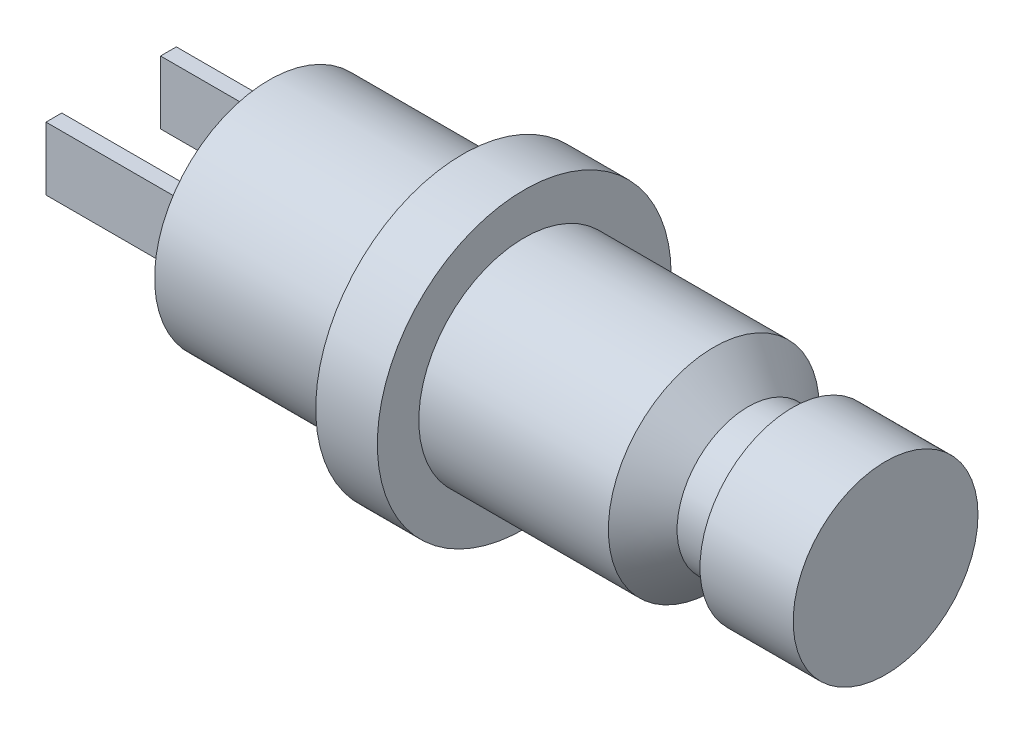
from build123d import *

# Parameters (mm, degrees)
SKETCH2_W           = 0.508
SKETCH2_H           = 2.032
BOSS_EXTRUDE1_DEPTH = 5.08


with BuildPart() as part:
    # Sketch1 → Revolve1 (revolve)
    with BuildSketch(Plane.XY, mode=Mode.PRIVATE) as revolve1_sk:
        Polygon((0, 3.683), (6.223, 3.683), (6.223, 4.7244), (8.2042, 4.7244), (8.2042, 3.3909), (14.3002, 3.3909), (15.4051, 2.286), (16.8275, 2.286), (16.8275, 2.9718), (19.8247, 2.9718), (19.8247, 0), (0, 0), align=None)
    revolve(revolve1_sk.sketch.rotate(Axis((0, 0, 0), (-1, 0, 0)), 90), axis=Axis((0, 0, 0), (-1, 0, 0)))

    # Sketch2 → Boss-Extrude1 (add)
    with BuildSketch(Plane.ZY):
        with Locations((-1.8415, 0)):
            Rectangle(SKETCH2_W, SKETCH2_H)
        with Locations((1.8415, 0)):
            Rectangle(SKETCH2_W, SKETCH2_H)
    extrude(amount=BOSS_EXTRUDE1_DEPTH)


solid = part.part
